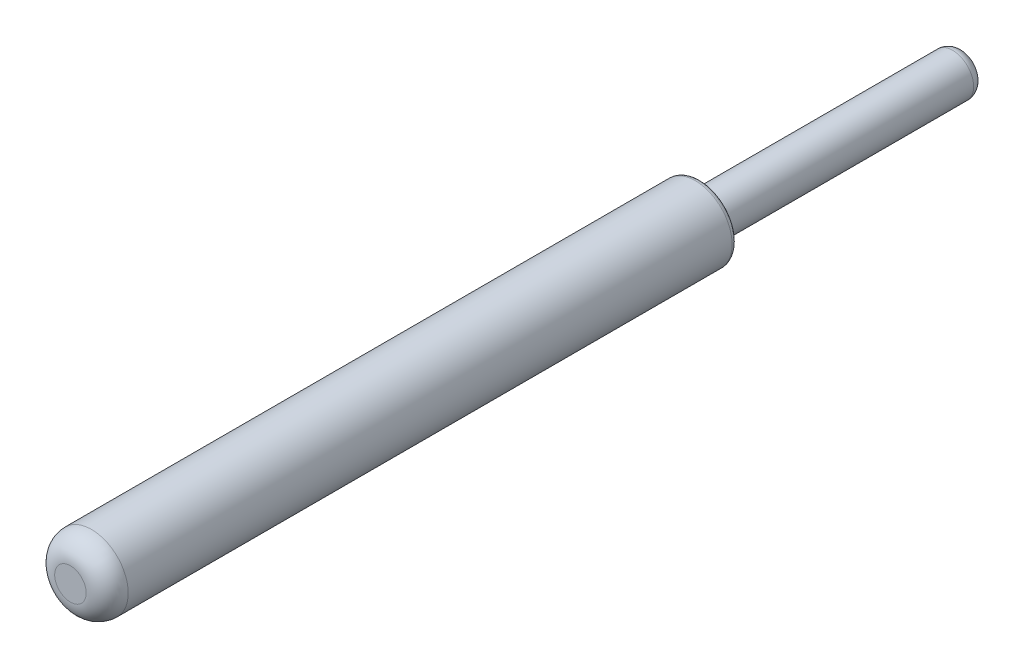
from build123d import *

# Parameters (mm, degrees)
SKETCH_1_R      = 2
EXTRUDE_1_DEPTH = 25
SKETCH_2_R      = 3.5
EXTRUDE_2_DEPTH = 60
FILLET_1_R      = 2
FILLET_2_R      = 1
FILLET_3_R      = 0.5


with BuildPart() as part:
    # Sketch 1 → Extrude 1 (new body)
    with BuildSketch(Plane.XY):
        Circle(SKETCH_1_R)
    extrude(amount=EXTRUDE_1_DEPTH)

    # Sketch 2 → Extrude 2 (add)
    with BuildSketch(Plane.XY.offset(25)):
        Circle(SKETCH_2_R)
    extrude(amount=EXTRUDE_2_DEPTH)

    # Fillet 1
    fillet_1_edges = [part.edges().sort_by_distance(p)[0] for p in [
        (-3.5, 0, 85),
    ]]
    fillet(fillet_1_edges, radius=FILLET_1_R)

    # Fillet 2
    fillet_2_edges = [part.edges().sort_by_distance(p)[0] for p in [
        (-2, 0, 0),
    ]]
    fillet(fillet_2_edges, radius=FILLET_2_R)

    # Fillet 3
    fillet_3_edges = [part.edges().sort_by_distance(p)[0] for p in [
        (-3.5, 0, 25),
    ]]
    fillet(fillet_3_edges, radius=FILLET_3_R)


solid = part.part
